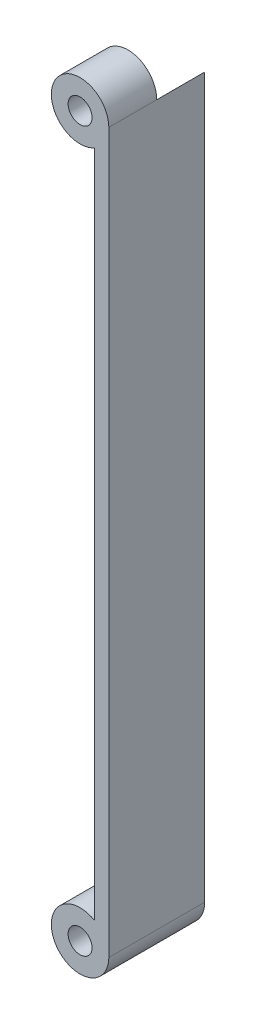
ISO-10303-21;
HEADER;
FILE_DESCRIPTION(('STEP AP214'),'2;1');
FILE_NAME('part.step','',(''),(''),'','','');
FILE_SCHEMA(('AUTOMOTIVE_DESIGN { 1 0 10303 214 1 1 1 1 }'));
ENDSEC;
DATA;
#1=APPLICATION_CONTEXT('core data for automotive mechanical design processes');
#2=APPLICATION_PROTOCOL_DEFINITION('international standard','automotive_design',2000,#1);
#3=PRODUCT_CONTEXT('',#1,'mechanical');
#4=PRODUCT('Part','Part','',(#3));
#5=PRODUCT_RELATED_PRODUCT_CATEGORY('part','',(#4));
#6=PRODUCT_DEFINITION_FORMATION('','',#4);
#7=PRODUCT_DEFINITION_CONTEXT('part definition',#1,'design');
#8=PRODUCT_DEFINITION('design','',#6,#7);
#9=PRODUCT_DEFINITION_SHAPE('','',#8);
#10=(LENGTH_UNIT() NAMED_UNIT(*) SI_UNIT(.MILLI.,.METRE.));
#11=(NAMED_UNIT(*) PLANE_ANGLE_UNIT() SI_UNIT($,.RADIAN.));
#12=(NAMED_UNIT(*) SI_UNIT($,.STERADIAN.) SOLID_ANGLE_UNIT());
#13=UNCERTAINTY_MEASURE_WITH_UNIT(LENGTH_MEASURE(1.E-05),#10,'distance_accuracy_value','');
#14=(GEOMETRIC_REPRESENTATION_CONTEXT(3) GLOBAL_UNCERTAINTY_ASSIGNED_CONTEXT((#13)) GLOBAL_UNIT_ASSIGNED_CONTEXT((#10,
#11,#12)) REPRESENTATION_CONTEXT('',''));
#15=CARTESIAN_POINT('',(0.,0.,0.));
#16=DIRECTION('',(0.,0.,1.));
#17=DIRECTION('',(1.,0.,0.));
#18=AXIS2_PLACEMENT_3D('',#15,#16,#17);
#19=CARTESIAN_POINT('',(0.,150.,20.));
#20=DIRECTION('',(0.,0.,-1.));
#21=DIRECTION('',(-1.,0.,0.));
#22=AXIS2_PLACEMENT_3D('',#19,#20,#21);
#23=CYLINDRICAL_SURFACE('',#22,6.);
#24=CARTESIAN_POINT('',(0.,150.,10.));
#25=DIRECTION('',(0.,0.,-1.));
#26=DIRECTION('',(-1.,0.,0.));
#27=AXIS2_PLACEMENT_3D('',#24,#25,#26);
#28=CIRCLE('',#27,6.00000000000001);
#29=CARTESIAN_POINT('',(2.99999999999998,144.803847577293,10.));
#30=VERTEX_POINT('',#29);
#31=CARTESIAN_POINT('',(5.99999999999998,150.,10.));
#32=VERTEX_POINT('',#31);
#33=EDGE_CURVE('E105',#30,#32,#28,.T.);
#34=ORIENTED_EDGE('',*,*,#33,.F.);
#35=DIRECTION('',(0.,0.,-1.));
#36=VECTOR('',#35,1.);
#37=CARTESIAN_POINT('',(2.99999999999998,144.803847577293,20.));
#38=LINE('',#37,#36);
#39=CARTESIAN_POINT('',(2.99999999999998,144.803847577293,20.));
#40=VERTEX_POINT('',#39);
#41=EDGE_CURVE('E11',#40,#30,#38,.T.);
#42=ORIENTED_EDGE('',*,*,#41,.F.);
#43=CARTESIAN_POINT('',(0.,150.,20.));
#44=DIRECTION('',(0.,0.,1.));
#45=DIRECTION('',(1.,0.,0.));
#46=AXIS2_PLACEMENT_3D('',#43,#44,#45);
#47=CIRCLE('',#46,6.);
#48=CARTESIAN_POINT('',(5.99999999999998,150.,20.));
#49=VERTEX_POINT('',#48);
#50=EDGE_CURVE('E109',#49,#40,#47,.T.);
#51=ORIENTED_EDGE('',*,*,#50,.F.);
#52=DIRECTION('',(0.,0.,-1.));
#53=VECTOR('',#52,1.);
#54=CARTESIAN_POINT('',(5.99999999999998,150.,20.));
#55=LINE('',#54,#53);
#56=EDGE_CURVE('E96',#49,#32,#55,.T.);
#57=ORIENTED_EDGE('',*,*,#56,.T.);
#58=EDGE_LOOP('',(#34,#42,#51,#57));
#59=FACE_BOUND('',#58,.T.);
#60=ADVANCED_FACE('F33',(#59),#23,.T.);
#61=CARTESIAN_POINT('',(0.,150.,20.));
#62=DIRECTION('',(0.,0.,-1.));
#63=DIRECTION('',(-1.,0.,0.));
#64=AXIS2_PLACEMENT_3D('',#61,#62,#63);
#65=CYLINDRICAL_SURFACE('',#64,2.5);
#66=CARTESIAN_POINT('',(0.,150.,20.));
#67=DIRECTION('',(0.,0.,1.));
#68=DIRECTION('',(1.,0.,0.));
#69=AXIS2_PLACEMENT_3D('',#66,#67,#68);
#70=CIRCLE('',#69,2.5);
#71=CARTESIAN_POINT('',(2.49999999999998,150.,20.));
#72=VERTEX_POINT('',#71);
#73=EDGE_CURVE('E130',#72,#72,#70,.T.);
#74=ORIENTED_EDGE('',*,*,#73,.T.);
#75=EDGE_LOOP('',(#74));
#76=FACE_BOUND('',#75,.T.);
#77=CARTESIAN_POINT('',(0.,150.,10.));
#78=DIRECTION('',(0.,0.,-1.));
#79=DIRECTION('',(-1.,0.,0.));
#80=AXIS2_PLACEMENT_3D('',#77,#78,#79);
#81=CIRCLE('',#80,2.5);
#82=CARTESIAN_POINT('',(-2.50000000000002,150.,10.));
#83=VERTEX_POINT('',#82);
#84=EDGE_CURVE('E36',#83,#83,#81,.T.);
#85=ORIENTED_EDGE('',*,*,#84,.T.);
#86=EDGE_LOOP('',(#85));
#87=FACE_BOUND('',#86,.T.);
#88=ADVANCED_FACE('F145',(#76,#87),#65,.F.);
#89=CARTESIAN_POINT('',(0.,150.,20.));
#90=DIRECTION('',(0.,0.,1.));
#91=DIRECTION('',(1.,0.,0.));
#92=AXIS2_PLACEMENT_3D('',#89,#90,#91);
#93=PLANE('',#92);
#94=CARTESIAN_POINT('',(0.,0.,20.));
#95=DIRECTION('',(0.,0.,1.));
#96=DIRECTION('',(1.,0.,0.));
#97=AXIS2_PLACEMENT_3D('',#94,#95,#96);
#98=CIRCLE('',#97,2.5);
#99=CARTESIAN_POINT('',(2.5,0.,20.));
#100=VERTEX_POINT('',#99);
#101=EDGE_CURVE('E121',#100,#100,#98,.T.);
#102=ORIENTED_EDGE('',*,*,#101,.F.);
#103=EDGE_LOOP('',(#102));
#104=FACE_BOUND('',#103,.T.);
#105=ORIENTED_EDGE('',*,*,#50,.T.);
#106=DIRECTION('',(0.,-1.,0.));
#107=VECTOR('',#106,1.);
#108=CARTESIAN_POINT('',(2.99999999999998,144.803847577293,20.));
#109=LINE('',#108,#107);
#110=CARTESIAN_POINT('',(3.,5.19615242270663,20.));
#111=VERTEX_POINT('',#110);
#112=EDGE_CURVE('E80',#40,#111,#109,.T.);
#113=ORIENTED_EDGE('',*,*,#112,.T.);
#114=CARTESIAN_POINT('',(0.,0.,20.));
#115=DIRECTION('',(0.,0.,1.));
#116=DIRECTION('',(1.,0.,0.));
#117=AXIS2_PLACEMENT_3D('',#114,#115,#116);
#118=CIRCLE('',#117,6.);
#119=CARTESIAN_POINT('',(6.,0.,20.));
#120=VERTEX_POINT('',#119);
#121=EDGE_CURVE('E118',#111,#120,#118,.T.);
#122=ORIENTED_EDGE('',*,*,#121,.T.);
#123=DIRECTION('',(0.,1.,0.));
#124=VECTOR('',#123,1.);
#125=CARTESIAN_POINT('',(5.99999999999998,150.,20.));
#126=LINE('',#125,#124);
#127=EDGE_CURVE('E57',#120,#49,#126,.T.);
#128=ORIENTED_EDGE('',*,*,#127,.T.);
#129=EDGE_LOOP('',(#105,#113,#122,#128));
#130=FACE_BOUND('',#129,.T.);
#131=ORIENTED_EDGE('',*,*,#73,.F.);
#132=EDGE_LOOP('',(#131));
#133=FACE_BOUND('',#132,.T.);
#134=ADVANCED_FACE('F142',(#104,#130,#133),#93,.T.);
#135=CARTESIAN_POINT('',(0.,150.,0.));
#136=DIRECTION('',(0.,0.,1.));
#137=DIRECTION('',(1.,0.,0.));
#138=AXIS2_PLACEMENT_3D('',#135,#136,#137);
#139=PLANE('',#138);
#140=DIRECTION('',(0.,-1.,0.));
#141=VECTOR('',#140,1.);
#142=CARTESIAN_POINT('',(2.99999999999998,144.803847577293,0.));
#143=LINE('',#142,#141);
#144=CARTESIAN_POINT('',(2.99999999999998,144.803847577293,0.));
#145=VERTEX_POINT('',#144);
#146=CARTESIAN_POINT('',(3.,5.19615242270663,0.));
#147=VERTEX_POINT('',#146);
#148=EDGE_CURVE('E104',#145,#147,#143,.T.);
#149=ORIENTED_EDGE('',*,*,#148,.F.);
#150=CARTESIAN_POINT('',(0.,150.,0.));
#151=DIRECTION('',(0.,0.,-1.));
#152=DIRECTION('',(-1.,0.,0.));
#153=AXIS2_PLACEMENT_3D('',#150,#151,#152);
#154=CIRCLE('',#153,6.00000000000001);
#155=CARTESIAN_POINT('',(5.99999999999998,150.,0.));
#156=VERTEX_POINT('',#155);
#157=EDGE_CURVE('E91',#156,#145,#154,.T.);
#158=ORIENTED_EDGE('',*,*,#157,.F.);
#159=DIRECTION('',(0.,1.,0.));
#160=VECTOR('',#159,1.);
#161=CARTESIAN_POINT('',(5.99999999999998,150.,0.));
#162=LINE('',#161,#160);
#163=CARTESIAN_POINT('',(6.,0.,0.));
#164=VERTEX_POINT('',#163);
#165=EDGE_CURVE('E103',#164,#156,#162,.T.);
#166=ORIENTED_EDGE('',*,*,#165,.F.);
#167=CARTESIAN_POINT('',(0.,0.,0.));
#168=DIRECTION('',(0.,0.,1.));
#169=DIRECTION('',(1.,0.,0.));
#170=AXIS2_PLACEMENT_3D('',#167,#168,#169);
#171=CIRCLE('',#170,6.);
#172=EDGE_CURVE('E73',#147,#164,#171,.T.);
#173=ORIENTED_EDGE('',*,*,#172,.F.);
#174=EDGE_LOOP('',(#149,#158,#166,#173));
#175=FACE_BOUND('',#174,.T.);
#176=CARTESIAN_POINT('',(0.,0.,0.));
#177=DIRECTION('',(0.,0.,1.));
#178=DIRECTION('',(1.,0.,0.));
#179=AXIS2_PLACEMENT_3D('',#176,#177,#178);
#180=CIRCLE('',#179,2.5);
#181=CARTESIAN_POINT('',(2.5,0.,0.));
#182=VERTEX_POINT('',#181);
#183=EDGE_CURVE('E123',#182,#182,#180,.T.);
#184=ORIENTED_EDGE('',*,*,#183,.T.);
#185=EDGE_LOOP('',(#184));
#186=FACE_BOUND('',#185,.T.);
#187=ADVANCED_FACE('F101',(#175,#186),#139,.F.);
#188=CARTESIAN_POINT('',(2.99999999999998,144.803847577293,20.));
#189=DIRECTION('',(1.,0.,0.));
#190=DIRECTION('',(0.,1.,0.));
#191=AXIS2_PLACEMENT_3D('',#188,#189,#190);
#192=PLANE('',#191);
#193=ORIENTED_EDGE('',*,*,#148,.T.);
#194=DIRECTION('',(0.,0.,-1.));
#195=VECTOR('',#194,1.);
#196=CARTESIAN_POINT('',(3.,5.19615242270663,20.));
#197=LINE('',#196,#195);
#198=EDGE_CURVE('E41',#111,#147,#197,.T.);
#199=ORIENTED_EDGE('',*,*,#198,.F.);
#200=ORIENTED_EDGE('',*,*,#112,.F.);
#201=ORIENTED_EDGE('',*,*,#41,.T.);
#202=DIRECTION('',(0.,0.,-1.));
#203=VECTOR('',#202,1.);
#204=CARTESIAN_POINT('',(2.99999999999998,144.803847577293,10.));
#205=LINE('',#204,#203);
#206=EDGE_CURVE('E120',#30,#145,#205,.T.);
#207=ORIENTED_EDGE('',*,*,#206,.T.);
#208=EDGE_LOOP('',(#193,#199,#200,#201,#207));
#209=FACE_BOUND('',#208,.T.);
#210=ADVANCED_FACE('F119',(#209),#192,.F.);
#211=CARTESIAN_POINT('',(0.,0.,20.));
#212=DIRECTION('',(0.,0.,-1.));
#213=DIRECTION('',(-1.,0.,0.));
#214=AXIS2_PLACEMENT_3D('',#211,#212,#213);
#215=CYLINDRICAL_SURFACE('',#214,6.);
#216=ORIENTED_EDGE('',*,*,#172,.T.);
#217=DIRECTION('',(0.,0.,-1.));
#218=VECTOR('',#217,1.);
#219=CARTESIAN_POINT('',(6.,0.,20.));
#220=LINE('',#219,#218);
#221=EDGE_CURVE('E108',#120,#164,#220,.T.);
#222=ORIENTED_EDGE('',*,*,#221,.F.);
#223=ORIENTED_EDGE('',*,*,#121,.F.);
#224=ORIENTED_EDGE('',*,*,#198,.T.);
#225=EDGE_LOOP('',(#216,#222,#223,#224));
#226=FACE_BOUND('',#225,.T.);
#227=ADVANCED_FACE('F117',(#226),#215,.T.);
#228=CARTESIAN_POINT('',(5.99999999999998,150.,20.));
#229=DIRECTION('',(-1.,0.,0.));
#230=DIRECTION('',(0.,-1.,0.));
#231=AXIS2_PLACEMENT_3D('',#228,#229,#230);
#232=PLANE('',#231);
#233=ORIENTED_EDGE('',*,*,#165,.T.);
#234=EDGE_CURVE('E88',#32,#156,#55,.T.);
#235=ORIENTED_EDGE('',*,*,#234,.F.);
#236=ORIENTED_EDGE('',*,*,#56,.F.);
#237=ORIENTED_EDGE('',*,*,#127,.F.);
#238=ORIENTED_EDGE('',*,*,#221,.T.);
#239=EDGE_LOOP('',(#233,#235,#236,#237,#238));
#240=FACE_BOUND('',#239,.T.);
#241=ADVANCED_FACE('F107',(#240),#232,.F.);
#242=CARTESIAN_POINT('',(0.,0.,20.));
#243=DIRECTION('',(0.,0.,-1.));
#244=DIRECTION('',(-1.,0.,0.));
#245=AXIS2_PLACEMENT_3D('',#242,#243,#244);
#246=CYLINDRICAL_SURFACE('',#245,2.5);
#247=ORIENTED_EDGE('',*,*,#101,.T.);
#248=EDGE_LOOP('',(#247));
#249=FACE_BOUND('',#248,.T.);
#250=ORIENTED_EDGE('',*,*,#183,.F.);
#251=EDGE_LOOP('',(#250));
#252=FACE_BOUND('',#251,.T.);
#253=ADVANCED_FACE('F160',(#249,#252),#246,.F.);
#254=CARTESIAN_POINT('',(0.,150.,10.));
#255=DIRECTION('',(0.,0.,-1.));
#256=DIRECTION('',(-1.,0.,0.));
#257=AXIS2_PLACEMENT_3D('',#254,#255,#256);
#258=CYLINDRICAL_SURFACE('',#257,6.00000000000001);
#259=EDGE_CURVE('E48',#32,#30,#28,.T.);
#260=ORIENTED_EDGE('',*,*,#259,.F.);
#261=ORIENTED_EDGE('',*,*,#234,.T.);
#262=ORIENTED_EDGE('',*,*,#157,.T.);
#263=ORIENTED_EDGE('',*,*,#206,.F.);
#264=EDGE_LOOP('',(#260,#261,#262,#263));
#265=FACE_BOUND('',#264,.T.);
#266=ADVANCED_FACE('F90',(#265),#258,.F.);
#267=CARTESIAN_POINT('',(0.,150.,10.));
#268=DIRECTION('',(0.,0.,-1.));
#269=DIRECTION('',(-1.,0.,0.));
#270=AXIS2_PLACEMENT_3D('',#267,#268,#269);
#271=PLANE('',#270);
#272=ORIENTED_EDGE('',*,*,#84,.F.);
#273=EDGE_LOOP('',(#272));
#274=FACE_BOUND('',#273,.T.);
#275=ORIENTED_EDGE('',*,*,#259,.T.);
#276=ORIENTED_EDGE('',*,*,#33,.T.);
#277=EDGE_LOOP('',(#275,#276));
#278=FACE_BOUND('',#277,.T.);
#279=ADVANCED_FACE('F138',(#274,#278),#271,.T.);
#280=CLOSED_SHELL('',(#60,#88,#134,#187,#210,#227,#241,#253,#266,#279));
#281=MANIFOLD_SOLID_BREP('B2',#280);
#282=ADVANCED_BREP_SHAPE_REPRESENTATION('',(#18,#281),#14);
#283=SHAPE_DEFINITION_REPRESENTATION(#9,#282);
ENDSEC;
END-ISO-10303-21;
